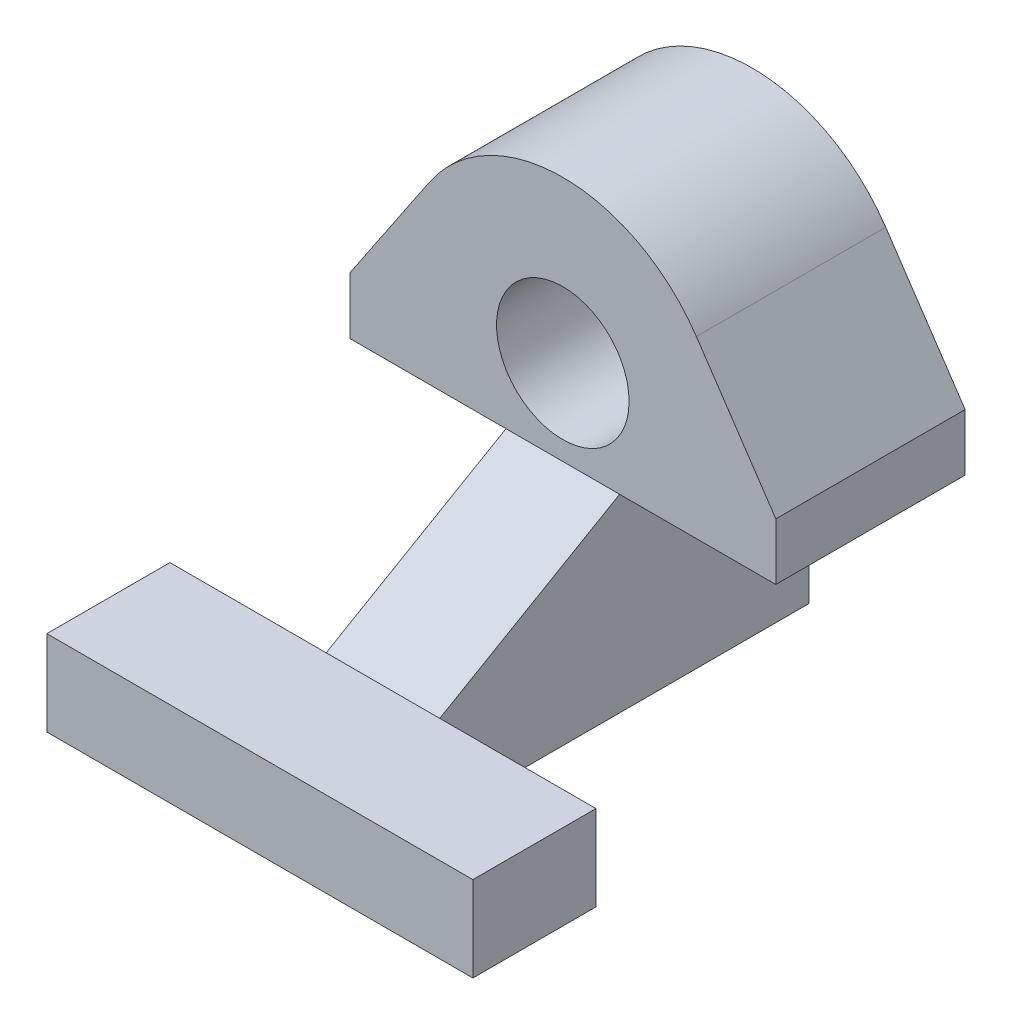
from build123d import *

# Parameters (mm, degrees)
SKETCH_1_R      = 7
EXTRUDE_1_DEPTH = 20
EXTRUDE_2_DEPTH = 6
SKETCH_3_W      = 13
SKETCH_3_H      = 9
EXTRUDE_3_DEPTH = 22.5


with BuildPart() as part:
    # Sketch 1 → Extrude 1 (new body)
    with BuildSketch(Plane.XY):
        with BuildLine():
            Line((-22.5, -9), (22.5, -9))
            Line((22.5, -9), (22.5, -3))
            Line((22.5, -3), (14.108921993, 9.483581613))
            ThreePointArc((14.108921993, 9.483581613), (0, 17), (-14.108921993, 9.483581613))
            Line((-14.108921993, 9.483581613), (-22.5, -3))
            Line((-22.5, -3), (-22.5, -9))
        make_face()
        Circle(SKETCH_1_R, mode=Mode.SUBTRACT)
    extrude(amount=EXTRUDE_1_DEPTH)

    # Sketch 2 → Extrude 2 (add, symmetric)
    with BuildSketch(Plane(origin=(0, 0, 0), x_dir=(0, 0, -1), z_dir=(1, 0, 0))):
        Polygon((0, -9), (0, -29), (-39, -29), (-39, -20), (-20, -9), align=None)
    extrude(amount=EXTRUDE_2_DEPTH, both=True)

    # Sketch 3 → Extrude 3 (add, symmetric)
    with BuildSketch(Plane(origin=(0, 0, 0), x_dir=(0, 0, -1), z_dir=(1, 0, 0))):
        with Locations((-45.5, -24.5)):
            Rectangle(SKETCH_3_W, SKETCH_3_H)
    extrude(amount=EXTRUDE_3_DEPTH, both=True)


solid = part.part
